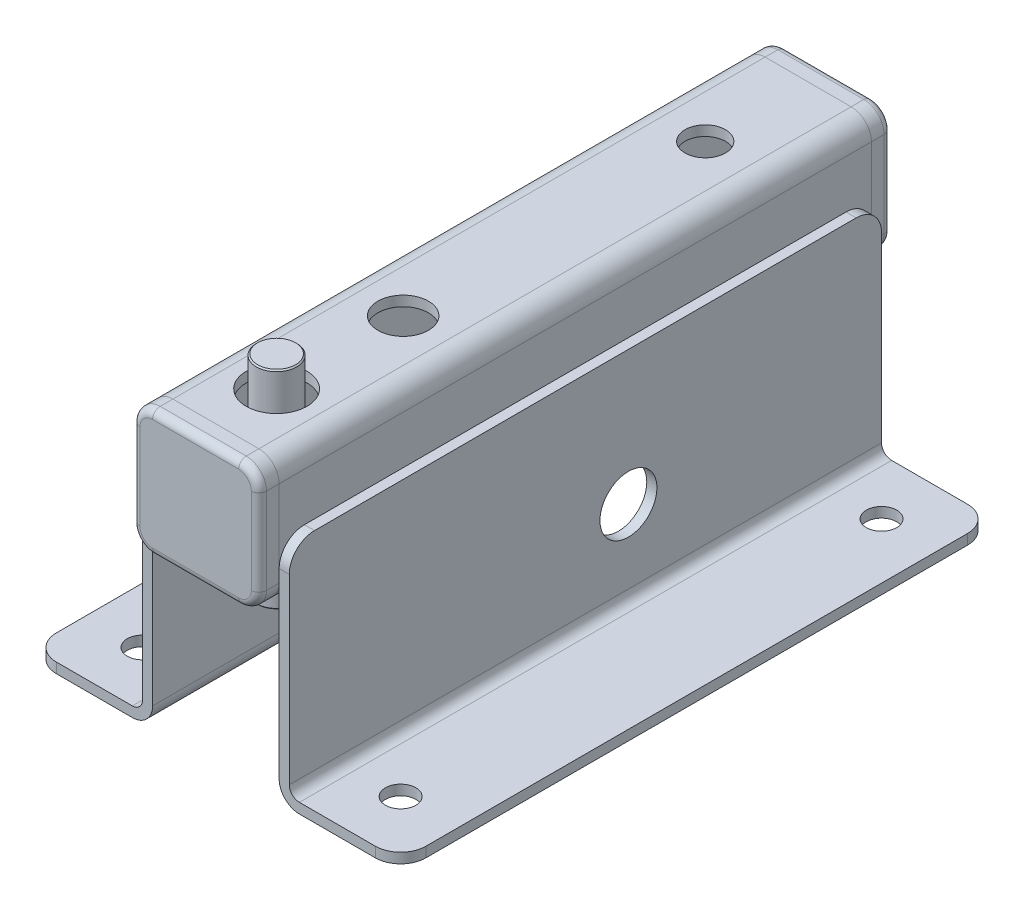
from build123d import *

# Parameters (mm, degrees)
BOSS_EXTRU_1_DEPTH      = 117
BOSS_EXTRU_2_DEPTH      = 117
BOSS_EXTRU_2_2_DEPTH    = 117
ESQUISSE3_R             = 6
ENL_V_MAT_EXTRU_1_DEPTH = 25
ESQUISSE9_W             = 9.764829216
ESQUISSE9_H             = 0.8
ENL_V_MAT_EXTRU_3_DEPTH = 10
ESQUISSE10_R            = 3
ENL_V_MAT_EXTRU_4_DEPTH = 2
ESQUISSE11_R            = 4
ESQUISSE11_R_2          = 5
ENL_V_MAT_EXTRU_5_DEPTH = 2
ESQUISSE12_R            = 2.25
ENL_V_MAT_EXTRU_6_DEPTH = 2
CONG_2_R                = 5
CONG_3_R                = 5
BOSS_EXTRU_5_DEPTH      = 4
CONG_4_R                = 1.5
BOSS_EXTRU_6_DEPTH      = 4
CONG_7_R                = 1.5
ESQUISSE17_R            = 5.625
ENL_V_MAT_EXTRU_7_DEPTH = 10
ESQUISSE18_R            = 5.625
ENL_V_MAT_EXTRU_8_DEPTH = 10
CONG_8_R                = 5
CONG_9_R                = 5


with BuildPart() as part:
    # Esquisse1 → Boss.-Extru.1 (new body)
    with BuildSketch(Plane.XY):
        with BuildLine():
            Line((-8.5, 12.5), (8.5, 12.5))
            ThreePointArc((8.5, 12.5), (11.328427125, 11.328427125), (12.5, 8.5))
            Line((12.5, 8.5), (12.5, -8.5))
            ThreePointArc((12.5, -8.5), (11.328427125, -11.328427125), (8.5, -12.5))
            Line((8.5, -12.5), (-8.5, -12.5))
            ThreePointArc((-8.5, -12.5), (-11.328427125, -11.328427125), (-12.5, -8.5))
            Line((-12.5, -8.5), (-12.5, 8.5))
            ThreePointArc((-12.5, 8.5), (-11.328427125, 11.328427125), (-8.5, 12.5))
        make_face()
        with BuildLine():
            Line((-8.5, 10.5), (8.5, 10.5))
            ThreePointArc((8.5, 10.5), (9.914213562, 9.914213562), (10.5, 8.5))
            Line((10.5, 8.5), (10.5, -8.5))
            ThreePointArc((10.5, -8.5), (9.914213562, -9.914213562), (8.5, -10.5))
            Line((8.5, -10.5), (-8.5, -10.5))
            ThreePointArc((-8.5, -10.5), (-9.914213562, -9.914213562), (-10.5, -8.5))
            Line((-10.5, -8.5), (-10.5, 8.5))
            ThreePointArc((-10.5, 8.5), (-9.914213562, 9.914213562), (-8.5, 10.5))
        make_face(mode=Mode.SUBTRACT)
    extrude(amount=-BOSS_EXTRU_1_DEPTH)

    # Esquisse3 → Enl_v. mat.-Extru.1 (cut)
    with BuildSketch(Plane(origin=(0, 12.5, 0), x_dir=(1, 0, 0), z_dir=(0, 1, 0))):
        with Locations(Location((0, 12, 0), (0, 0, 180))):
            Circle(ESQUISSE3_R)
    extrude(amount=-ENL_V_MAT_EXTRU_1_DEPTH, mode=Mode.SUBTRACT)

    # Esquisse11 → Enl_v. mat.-Extru.5 (cut)
    with BuildSketch(Plane(origin=(0, 12.5, 0), x_dir=(1, 0, 0), z_dir=(0, 1, 0))):
        with Locations(Location((0, 96.676697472, 0), (0, 0, 180))):
            Circle(ESQUISSE11_R)
        with Locations(Location((0, 37, 0), (0, 0, 180))):
            Circle(ESQUISSE11_R_2)
    extrude(amount=-ENL_V_MAT_EXTRU_5_DEPTH, mode=Mode.SUBTRACT)

    # Esquisse12 → Enl_v. mat.-Extru.6 (cut)
    with BuildSketch(Plane(origin=(0, -10.5, 0), x_dir=(1, 0, 0), z_dir=(0, 1, 0))):
        with Locations(Location((0, 37, 0), (0, 0, 180))):
            Circle(ESQUISSE12_R)
    extrude(amount=-ENL_V_MAT_EXTRU_6_DEPTH, mode=Mode.SUBTRACT)


with BuildPart() as body_2:
    # Esquisse2 → Boss.-Extru.2 (new body)
    with BuildSketch(Plane.XY):
        with BuildLine():
            Line((12.5, -1), (14.5, -1))
            Line((14.5, -1), (14.5, -42))
            ThreePointArc((14.5, -42), (15.085786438, -43.414213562), (16.5, -44))
            Line((16.5, -44), (36.5, -44))
            Line((36.5, -44), (36.5, -46))
            Line((36.5, -46), (16.5, -46))
            ThreePointArc((16.5, -46), (13.671572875, -44.828427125), (12.5, -42))
            Line((12.5, -42), (12.5, -1))
        make_face()
    extrude(amount=-BOSS_EXTRU_2_DEPTH)


with BuildPart() as body_3:
    # Esquisse2 → Boss.-Extru.2 2 (new body)
    with BuildSketch(Plane.XY):
        with BuildLine():
            Line((-12.5, -42), (-12.5, -1))
            Line((-12.5, -1), (-14.5, -1))
            Line((-14.5, -1), (-14.5, -42))
            ThreePointArc((-14.5, -42), (-15.085786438, -43.414213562), (-16.5, -44))
            Line((-16.5, -44), (-36.5, -44))
            Line((-36.5, -44), (-36.5, -46))
            Line((-36.5, -46), (-16.5, -46))
            ThreePointArc((-16.5, -46), (-13.671572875, -44.828427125), (-12.5, -42))
        make_face()
    extrude(amount=-BOSS_EXTRU_2_2_DEPTH)


with BuildPart() as body_4:
    # Esquisse6 → R_volution2 (revolve)
    with BuildSketch(Plane(origin=(0, 0, 0), x_dir=(0, 0, -1), z_dir=(1, 0, 0))):
        Polygon((12, -8.5), (8.825, -10.333087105), (8.825, -22.25), (8.575, -22.5), (8.25, -22.5), (8, -22.25), (8, 18.25), (8.25, 18.5), (12, 18.5), align=None)
    revolve(axis=Axis((0, 18.5, -12), (0, -1, 0)))

    # Esquisse9 → Enl_v. mat.-Extru.3 (cut)
    with BuildSketch(Plane.XZ.offset(22.5)):
        with Locations((0.175106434, -12)):
            Rectangle(ESQUISSE9_W, ESQUISSE9_H)
    extrude(amount=-ENL_V_MAT_EXTRU_3_DEPTH, mode=Mode.SUBTRACT)


with BuildPart() as enl_v_mat_extru_4_tool:
    # Esquisse10 → Enl_v. mat.-Extru.4 (new body)
    with BuildSketch(Plane(origin=(0, -44, 0), x_dir=(1, 0, 0), z_dir=(0, 1, 0))):
        with Locations(Location((25.5, 106, 0), (0, 0, 270))):
            Circle(ESQUISSE10_R)
        with Locations(Location((25.5, 11, 0), (0, 0, 270))):
            Circle(ESQUISSE10_R)
        with Locations(Location((-25.5, 106, 0), (0, 0, 270))):
            Circle(ESQUISSE10_R)
        with Locations(Location((-25.5, 11, 0), (0, 0, 270))):
            Circle(ESQUISSE10_R)
    extrude(amount=-ENL_V_MAT_EXTRU_4_DEPTH)


with BuildPart() as body_2_1:
    add(body_2.part)

    # Enl_v. mat.-Extru.4: cut by enl_v_mat_extru_4_tool
    add(enl_v_mat_extru_4_tool.part, mode=Mode.SUBTRACT)

    # Cong_2
    cong_2_edges = [body_2_1.edges().sort_by_distance(p)[0] for p in [
        (36.5, -45, -117),
        (36.5, -45, 0),
    ]]
    fillet(cong_2_edges, radius=CONG_2_R)

    # Esquisse17 → Enl_v. mat.-Extru.7 (cut)
    with BuildSketch(Plane(origin=(14.5, 0, 0), x_dir=(0, 0, -1), z_dir=(1, 0, 0))):
        with Locations(Location((67, -27.5, 0), (0, 0, 90))):
            Circle(ESQUISSE17_R)
    extrude(amount=-ENL_V_MAT_EXTRU_7_DEPTH, mode=Mode.SUBTRACT)

    # Cong_8
    cong_8_edges = [body_2_1.edges().sort_by_distance(p)[0] for p in [
        (13.5, -1, -117),
        (13.5, -1, 0),
    ]]
    fillet(cong_8_edges, radius=CONG_8_R)


with BuildPart() as body_3_1:
    add(body_3.part)

    # Enl_v. mat.-Extru.4: cut by enl_v_mat_extru_4_tool
    add(enl_v_mat_extru_4_tool.part, mode=Mode.SUBTRACT)

    # Cong_3
    cong_3_edges = [body_3_1.edges().sort_by_distance(p)[0] for p in [
        (-36.5, -45, -117),
        (-36.5, -45, 0),
    ]]
    fillet(cong_3_edges, radius=CONG_3_R)

    # Esquisse18 → Enl_v. mat.-Extru.8 (cut)
    with BuildSketch(Plane.ZY.offset(14.5)):
        with Locations(Location((-50, -27.5, 0), (0, 0, 270))):
            Circle(ESQUISSE18_R)
    extrude(amount=-ENL_V_MAT_EXTRU_8_DEPTH, mode=Mode.SUBTRACT)

    # Cong_9
    cong_9_edges = [body_3_1.edges().sort_by_distance(p)[0] for p in [
        (-13.5, -1, -117),
        (-13.5, -1, 0),
    ]]
    fillet(cong_9_edges, radius=CONG_9_R)


with BuildPart() as body_5:
    # Esquisse14 → Boss.-Extru.5 (new body)
    with BuildSketch(Plane.XY):
        with BuildLine():
            Line((-12.5, 8.5), (-12.5, -8.5))
            ThreePointArc((-12.5, -8.5), (-11.328427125, -11.328427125), (-8.5, -12.5))
            Line((-8.5, -12.5), (8.5, -12.5))
            ThreePointArc((8.5, -12.5), (11.328427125, -11.328427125), (12.5, -8.5))
            Line((12.5, -8.5), (12.5, 8.5))
            ThreePointArc((12.5, 8.5), (11.328427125, 11.328427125), (8.5, 12.5))
            Line((8.5, 12.5), (-8.5, 12.5))
            ThreePointArc((-8.5, 12.5), (-11.328427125, 11.328427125), (-12.5, 8.5))
        make_face()
    extrude(amount=BOSS_EXTRU_5_DEPTH)

    # Cong_4
    cong_4_edges = [body_5.edges().sort_by_distance(p)[0] for p in [
        (-11.328427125, -11.328427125, 4),
        (0, -12.5, 4),
        (11.328427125, -11.328427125, 4),
        (12.5, 0, 4),
        (11.328427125, 11.328427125, 4),
        (0, 12.5, 4),
        (-11.328427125, 11.328427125, 4),
        (-12.5, 0, 4),
    ]]
    fillet(cong_4_edges, radius=CONG_4_R)


with BuildPart() as body_6:
    # Esquisse16 → Boss.-Extru.6 (new body)
    with BuildSketch(Plane(origin=(0, 0, -117), x_dir=(-1, 0, 0), z_dir=(0, 0, -1))):
        with BuildLine():
            Line((8.5, 12.5), (-8.5, 12.5))
            ThreePointArc((-8.5, 12.5), (-11.328427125, 11.328427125), (-12.5, 8.5))
            Line((-12.5, 8.5), (-12.5, -8.5))
            ThreePointArc((-12.5, -8.5), (-11.328427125, -11.328427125), (-8.5, -12.5))
            Line((-8.5, -12.5), (8.5, -12.5))
            ThreePointArc((8.5, -12.5), (11.328427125, -11.328427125), (12.5, -8.5))
            Line((12.5, -8.5), (12.5, 8.5))
            ThreePointArc((12.5, 8.5), (11.328427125, 11.328427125), (8.5, 12.5))
        make_face()
    extrude(amount=BOSS_EXTRU_6_DEPTH)

    # Cong_7
    cong_7_edges = [body_6.edges().sort_by_distance(p)[0] for p in [
        (11.328427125, 11.328427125, -121),
        (12.5, 0, -121),
        (11.328427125, -11.328427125, -121),
        (0, -12.5, -121),
        (-11.328427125, -11.328427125, -121),
        (-12.5, 0, -121),
        (-11.328427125, 11.328427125, -121),
        (0, 12.5, -121),
    ]]
    fillet(cong_7_edges, radius=CONG_7_R)


solid = Compound([part.part, body_4.part, body_2_1.part, body_3_1.part, body_5.part, body_6.part])
